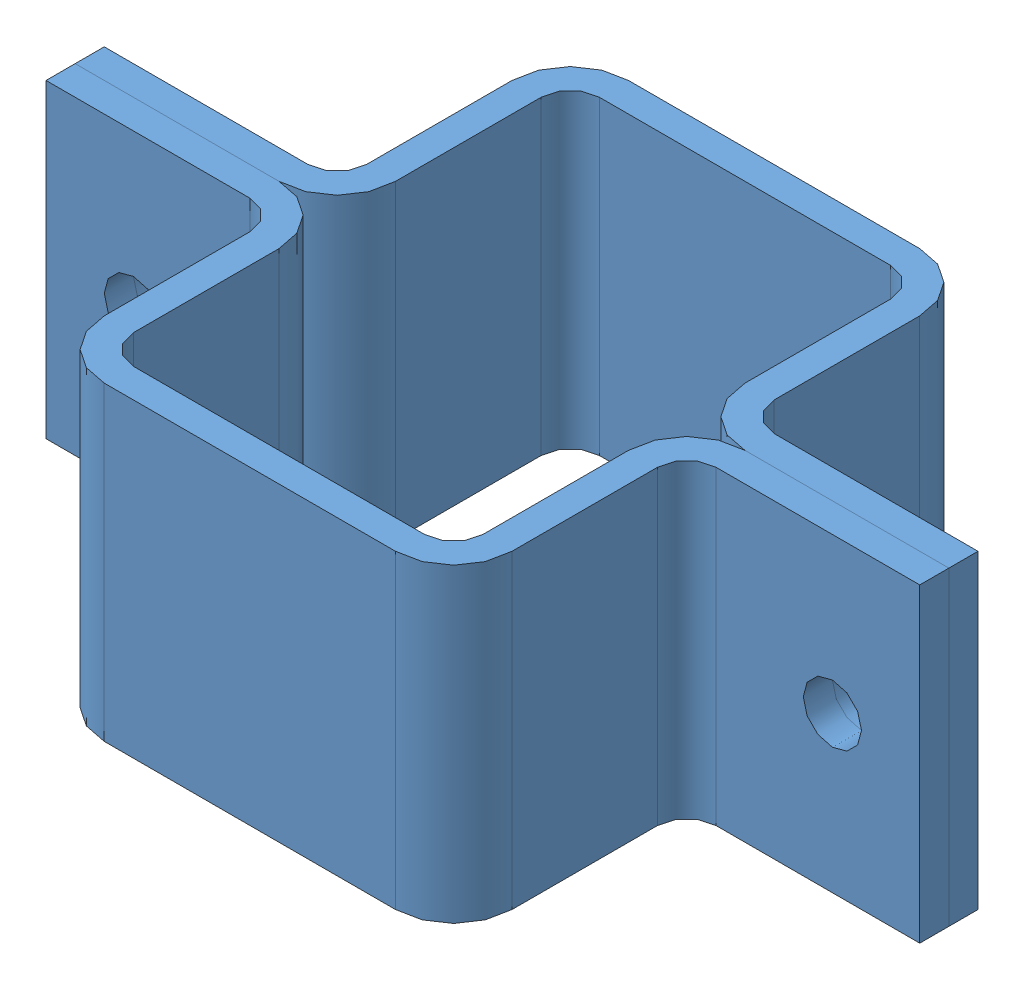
SolidWorks assembly Mirror.SLDASM, configuration Default (file format 6000). Lengths in mm.
Overall size (150 53.27 90).
2 component instances, 1 part files, 0 mates.
Components (placement in the parent):
- support-1: support.SLDPRT [Default] at origin size (150 53.27 45)
- support-2: support.SLDPRT [Default] x (1 0 0) z (0 0 -1) size (150 53.27 45)
